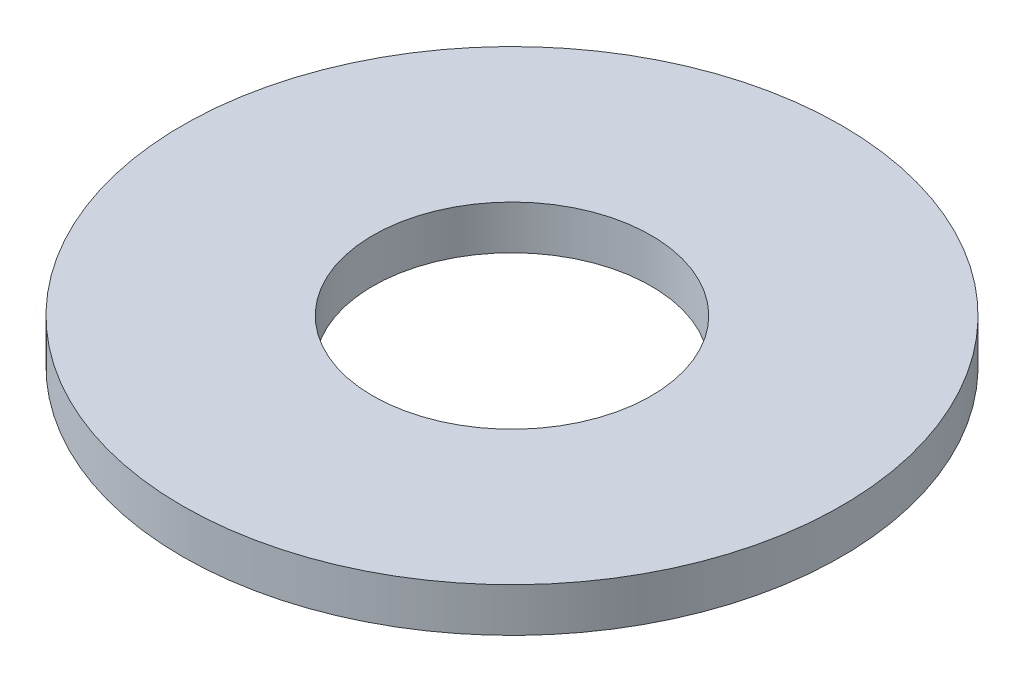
from build123d import *

# Parameters (mm, degrees)
ESQUISSE1_R      = 2.25
ESQUISSE1_R_2    = 0.95
EXTRUSION1_DEPTH = 0.3


with BuildPart() as part:
    # Esquisse1 → Extrusion1 (new body)
    with BuildSketch(Plane(origin=(0, 0, 0), x_dir=(1, 0, 0), z_dir=(0, 1, 0))):
        with Locations(Location((0, 0, 0), (0, 0, 270))):
            Circle(ESQUISSE1_R)
        with Locations(Location((0, 0, 0), (0, 0, 270))):
            Circle(ESQUISSE1_R_2, mode=Mode.SUBTRACT)
    extrude(amount=EXTRUSION1_DEPTH)


solid = part.part
